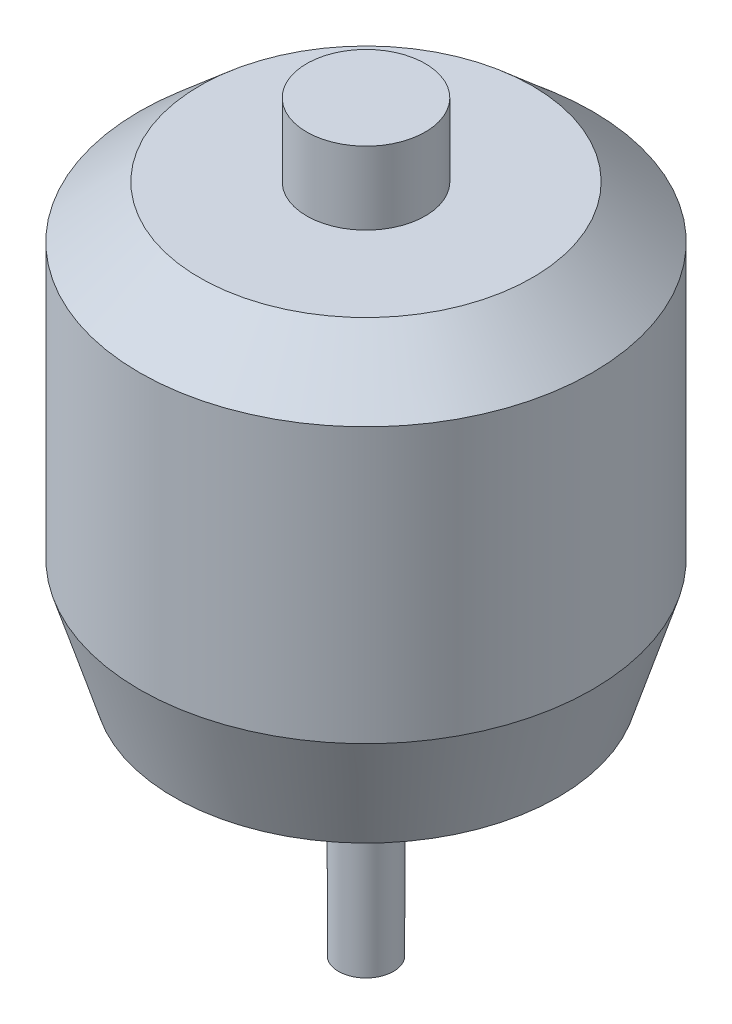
ISO-10303-21;
HEADER;
FILE_DESCRIPTION(('STEP AP214'),'2;1');
FILE_NAME('part.step','',(''),(''),'','','');
FILE_SCHEMA(('AUTOMOTIVE_DESIGN { 1 0 10303 214 1 1 1 1 }'));
ENDSEC;
DATA;
#1=APPLICATION_CONTEXT('core data for automotive mechanical design processes');
#2=APPLICATION_PROTOCOL_DEFINITION('international standard','automotive_design',2000,#1);
#3=PRODUCT_CONTEXT('',#1,'mechanical');
#4=PRODUCT('Part','Part','',(#3));
#5=PRODUCT_RELATED_PRODUCT_CATEGORY('part','',(#4));
#6=PRODUCT_DEFINITION_FORMATION('','',#4);
#7=PRODUCT_DEFINITION_CONTEXT('part definition',#1,'design');
#8=PRODUCT_DEFINITION('design','',#6,#7);
#9=PRODUCT_DEFINITION_SHAPE('','',#8);
#10=(LENGTH_UNIT() NAMED_UNIT(*) SI_UNIT(.MILLI.,.METRE.));
#11=(NAMED_UNIT(*) PLANE_ANGLE_UNIT() SI_UNIT($,.RADIAN.));
#12=(NAMED_UNIT(*) SI_UNIT($,.STERADIAN.) SOLID_ANGLE_UNIT());
#13=UNCERTAINTY_MEASURE_WITH_UNIT(LENGTH_MEASURE(1.E-05),#10,'distance_accuracy_value','');
#14=(GEOMETRIC_REPRESENTATION_CONTEXT(3) GLOBAL_UNCERTAINTY_ASSIGNED_CONTEXT((#13)) GLOBAL_UNIT_ASSIGNED_CONTEXT((#10,
#11,#12)) REPRESENTATION_CONTEXT('',''));
#15=CARTESIAN_POINT('',(0.,0.,0.));
#16=DIRECTION('',(0.,0.,1.));
#17=DIRECTION('',(1.,0.,0.));
#18=AXIS2_PLACEMENT_3D('',#15,#16,#17);
#19=CARTESIAN_POINT('',(0.,25.4,0.));
#20=DIRECTION('',(0.,-1.,0.));
#21=DIRECTION('',(0.,0.,-1.));
#22=AXIS2_PLACEMENT_3D('',#19,#20,#21);
#23=CYLINDRICAL_SURFACE('',#22,20.955);
#24=CARTESIAN_POINT('',(0.,25.4,0.));
#25=DIRECTION('',(0.,1.,0.));
#26=DIRECTION('',(0.,0.,1.));
#27=AXIS2_PLACEMENT_3D('',#24,#25,#26);
#28=CIRCLE('',#27,20.955);
#29=CARTESIAN_POINT('',(0.,25.4,20.955));
#30=VERTEX_POINT('',#29);
#31=EDGE_CURVE('E46',#30,#30,#28,.T.);
#32=ORIENTED_EDGE('',*,*,#31,.F.);
#33=EDGE_LOOP('',(#32));
#34=FACE_BOUND('',#33,.T.);
#35=CARTESIAN_POINT('',(0.,0.,0.));
#36=DIRECTION('',(0.,-1.,0.));
#37=DIRECTION('',(1.,0.,0.));
#38=AXIS2_PLACEMENT_3D('',#35,#36,#37);
#39=CIRCLE('',#38,20.955);
#40=CARTESIAN_POINT('',(20.955,0.,0.));
#41=VERTEX_POINT('',#40);
#42=EDGE_CURVE('E64',#41,#41,#39,.T.);
#43=ORIENTED_EDGE('',*,*,#42,.F.);
#44=EDGE_LOOP('',(#43));
#45=FACE_BOUND('',#44,.T.);
#46=ADVANCED_FACE('F36',(#34,#45),#23,.T.);
#47=CARTESIAN_POINT('',(0.,25.3999999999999,0.));
#48=DIRECTION('',(0.,-1.,0.));
#49=DIRECTION('',(0.,0.,-1.));
#50=AXIS2_PLACEMENT_3D('',#47,#48,#49);
#51=CONICAL_SURFACE('',#50,20.955,0.856184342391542);
#52=CARTESIAN_POINT('',(0.,30.226,0.));
#53=DIRECTION('',(0.,-1.,0.));
#54=DIRECTION('',(0.,0.,-1.));
#55=AXIS2_PLACEMENT_3D('',#52,#53,#54);
#56=CIRCLE('',#55,15.3924);
#57=CARTESIAN_POINT('',(0.,30.226,-15.3924));
#58=VERTEX_POINT('',#57);
#59=EDGE_CURVE('E51',#58,#58,#56,.T.);
#60=ORIENTED_EDGE('',*,*,#59,.T.);
#61=EDGE_LOOP('',(#60));
#62=FACE_BOUND('',#61,.T.);
#63=ORIENTED_EDGE('',*,*,#31,.T.);
#64=EDGE_LOOP('',(#63));
#65=FACE_BOUND('',#64,.T.);
#66=ADVANCED_FACE('F133',(#62,#65),#51,.T.);
#67=CARTESIAN_POINT('',(0.,30.226,-15.3924));
#68=DIRECTION('',(0.,1.,0.));
#69=DIRECTION('',(0.,0.,1.));
#70=AXIS2_PLACEMENT_3D('',#67,#68,#69);
#71=PLANE('',#70);
#72=CARTESIAN_POINT('',(0.,30.226,1.03682706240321E-13));
#73=DIRECTION('',(0.,1.,0.));
#74=DIRECTION('',(0.,0.,1.));
#75=AXIS2_PLACEMENT_3D('',#72,#73,#74);
#76=CIRCLE('',#75,5.4864);
#77=CARTESIAN_POINT('',(0.,30.226,5.4864000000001));
#78=VERTEX_POINT('',#77);
#79=EDGE_CURVE('E42',#78,#78,#76,.T.);
#80=ORIENTED_EDGE('',*,*,#79,.F.);
#81=EDGE_LOOP('',(#80));
#82=FACE_BOUND('',#81,.T.);
#83=ORIENTED_EDGE('',*,*,#59,.F.);
#84=EDGE_LOOP('',(#83));
#85=FACE_BOUND('',#84,.T.);
#86=ADVANCED_FACE('F138',(#82,#85),#71,.T.);
#87=CARTESIAN_POINT('',(0.,36.957,1.26771712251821E-13));
#88=DIRECTION('',(0.,-1.,0.));
#89=DIRECTION('',(0.,0.,-1.));
#90=AXIS2_PLACEMENT_3D('',#87,#88,#89);
#91=CYLINDRICAL_SURFACE('',#90,5.4864);
#92=CARTESIAN_POINT('',(0.,36.957,1.26771712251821E-13));
#93=DIRECTION('',(0.,1.,0.));
#94=DIRECTION('',(0.,0.,1.));
#95=AXIS2_PLACEMENT_3D('',#92,#93,#94);
#96=CIRCLE('',#95,5.4864);
#97=CARTESIAN_POINT('',(0.,36.957,5.48640000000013));
#98=VERTEX_POINT('',#97);
#99=EDGE_CURVE('E54',#98,#98,#96,.T.);
#100=ORIENTED_EDGE('',*,*,#99,.F.);
#101=EDGE_LOOP('',(#100));
#102=FACE_BOUND('',#101,.T.);
#103=ORIENTED_EDGE('',*,*,#79,.T.);
#104=EDGE_LOOP('',(#103));
#105=FACE_BOUND('',#104,.T.);
#106=ADVANCED_FACE('F155',(#102,#105),#91,.T.);
#107=CARTESIAN_POINT('',(0.,36.957,1.26771712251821E-13));
#108=DIRECTION('',(0.,1.,0.));
#109=DIRECTION('',(0.,0.,1.));
#110=AXIS2_PLACEMENT_3D('',#107,#108,#109);
#111=PLANE('',#110);
#112=ORIENTED_EDGE('',*,*,#99,.T.);
#113=EDGE_LOOP('',(#112));
#114=FACE_BOUND('',#113,.T.);
#115=ADVANCED_FACE('F111',(#114),#111,.T.);
#116=CARTESIAN_POINT('',(0.,-10.2108,0.));
#117=DIRECTION('',(0.,1.,0.));
#118=DIRECTION('',(-1.,0.,0.));
#119=AXIS2_PLACEMENT_3D('',#116,#117,#118);
#120=PLANE('',#119);
#121=CARTESIAN_POINT('',(-8.98025612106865,-10.2108,-8.98025612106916));
#122=DIRECTION('',(0.,-1.,0.));
#123=DIRECTION('',(1.,0.,0.));
#124=AXIS2_PLACEMENT_3D('',#121,#122,#123);
#125=CIRCLE('',#124,1.27000000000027);
#126=CARTESIAN_POINT('',(-7.71025612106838,-10.2108,-8.98025612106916));
#127=VERTEX_POINT('',#126);
#128=EDGE_CURVE('E80',#127,#127,#125,.T.);
#129=ORIENTED_EDGE('',*,*,#128,.F.);
#130=EDGE_LOOP('',(#129));
#131=FACE_BOUND('',#130,.T.);
#132=CARTESIAN_POINT('',(8.9802561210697,-10.2107999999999,-8.98025612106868));
#133=DIRECTION('',(0.,-1.,0.));
#134=DIRECTION('',(1.,0.,0.));
#135=AXIS2_PLACEMENT_3D('',#132,#133,#134);
#136=CIRCLE('',#135,1.27000000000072);
#137=CARTESIAN_POINT('',(10.2502561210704,-10.2107999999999,-8.98025612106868));
#138=VERTEX_POINT('',#137);
#139=EDGE_CURVE('E86',#138,#138,#136,.T.);
#140=ORIENTED_EDGE('',*,*,#139,.F.);
#141=EDGE_LOOP('',(#140));
#142=FACE_BOUND('',#141,.T.);
#143=CARTESIAN_POINT('',(8.98025612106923,-10.2107999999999,8.98025612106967));
#144=DIRECTION('',(0.,-1.,0.));
#145=DIRECTION('',(1.,0.,0.));
#146=AXIS2_PLACEMENT_3D('',#143,#144,#145);
#147=CIRCLE('',#146,1.27000000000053);
#148=CARTESIAN_POINT('',(10.2502561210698,-10.2107999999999,8.98025612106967));
#149=VERTEX_POINT('',#148);
#150=EDGE_CURVE('E92',#149,#149,#147,.T.);
#151=ORIENTED_EDGE('',*,*,#150,.F.);
#152=EDGE_LOOP('',(#151));
#153=FACE_BOUND('',#152,.T.);
#154=CARTESIAN_POINT('',(-8.98025612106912,-10.2108,8.98025612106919));
#155=DIRECTION('',(0.,-1.,0.));
#156=DIRECTION('',(1.,0.,0.));
#157=AXIS2_PLACEMENT_3D('',#154,#155,#156);
#158=CIRCLE('',#157,1.27);
#159=CARTESIAN_POINT('',(-7.71025612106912,-10.2108,8.98025612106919));
#160=VERTEX_POINT('',#159);
#161=EDGE_CURVE('E74',#160,#160,#158,.T.);
#162=ORIENTED_EDGE('',*,*,#161,.F.);
#163=EDGE_LOOP('',(#162));
#164=FACE_BOUND('',#163,.T.);
#165=CARTESIAN_POINT('',(0.,-10.2108,0.));
#166=DIRECTION('',(0.,1.,0.));
#167=DIRECTION('',(-1.,0.,0.));
#168=AXIS2_PLACEMENT_3D('',#165,#166,#167);
#169=CIRCLE('',#168,2.54);
#170=CARTESIAN_POINT('',(-2.53999999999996,-10.2108,0.));
#171=VERTEX_POINT('',#170);
#172=EDGE_CURVE('E10',#171,#171,#169,.F.);
#173=ORIENTED_EDGE('',*,*,#172,.F.);
#174=EDGE_LOOP('',(#173));
#175=FACE_BOUND('',#174,.T.);
#176=CARTESIAN_POINT('',(0.,-10.2107999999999,0.));
#177=DIRECTION('',(0.,-1.,0.));
#178=DIRECTION('',(1.,0.,0.));
#179=AXIS2_PLACEMENT_3D('',#176,#177,#178);
#180=CIRCLE('',#179,17.78);
#181=CARTESIAN_POINT('',(17.7800000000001,-10.2107999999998,0.));
#182=VERTEX_POINT('',#181);
#183=EDGE_CURVE('E60',#182,#182,#180,.T.);
#184=ORIENTED_EDGE('',*,*,#183,.T.);
#185=EDGE_LOOP('',(#184));
#186=FACE_BOUND('',#185,.T.);
#187=ADVANCED_FACE('F107',(#131,#142,#153,#164,#175,#186),#120,.F.);
#188=CARTESIAN_POINT('',(0.,0.,0.));
#189=DIRECTION('',(0.,1.,0.));
#190=DIRECTION('',(-1.,0.,0.));
#191=AXIS2_PLACEMENT_3D('',#188,#189,#190);
#192=CONICAL_SURFACE('',#191,20.955,0.301467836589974);
#193=ORIENTED_EDGE('',*,*,#183,.F.);
#194=EDGE_LOOP('',(#193));
#195=FACE_BOUND('',#194,.T.);
#196=ORIENTED_EDGE('',*,*,#42,.T.);
#197=EDGE_LOOP('',(#196));
#198=FACE_BOUND('',#197,.T.);
#199=ADVANCED_FACE('F110',(#195,#198),#192,.T.);
#200=CARTESIAN_POINT('',(1.09084662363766E-13,-31.8008,0.));
#201=DIRECTION('',(0.,1.,0.));
#202=DIRECTION('',(-1.,0.,0.));
#203=AXIS2_PLACEMENT_3D('',#200,#201,#202);
#204=CYLINDRICAL_SURFACE('',#203,2.54);
#205=CARTESIAN_POINT('',(1.09084662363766E-13,-31.8008,0.));
#206=DIRECTION('',(0.,-1.,0.));
#207=DIRECTION('',(1.,0.,0.));
#208=AXIS2_PLACEMENT_3D('',#205,#206,#207);
#209=CIRCLE('',#208,2.54);
#210=CARTESIAN_POINT('',(2.54000000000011,-31.8008,0.));
#211=VERTEX_POINT('',#210);
#212=EDGE_CURVE('E68',#211,#211,#209,.T.);
#213=ORIENTED_EDGE('',*,*,#212,.F.);
#214=EDGE_LOOP('',(#213));
#215=FACE_BOUND('',#214,.T.);
#216=ORIENTED_EDGE('',*,*,#172,.T.);
#217=EDGE_LOOP('',(#216));
#218=FACE_BOUND('',#217,.T.);
#219=ADVANCED_FACE('F128',(#215,#218),#204,.T.);
#220=CARTESIAN_POINT('',(1.09084662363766E-13,-31.8008,0.));
#221=DIRECTION('',(0.,-1.,0.));
#222=DIRECTION('',(1.,0.,0.));
#223=AXIS2_PLACEMENT_3D('',#220,#221,#222);
#224=PLANE('',#223);
#225=ORIENTED_EDGE('',*,*,#212,.T.);
#226=EDGE_LOOP('',(#225));
#227=FACE_BOUND('',#226,.T.);
#228=ADVANCED_FACE('F119',(#227),#224,.T.);
#229=CARTESIAN_POINT('',(-8.98025612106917,2.4892,8.98025612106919));
#230=DIRECTION('',(0.,-1.,0.));
#231=DIRECTION('',(1.,0.,0.));
#232=AXIS2_PLACEMENT_3D('',#229,#230,#231);
#233=CYLINDRICAL_SURFACE('',#232,1.27);
#234=CARTESIAN_POINT('',(-8.98025612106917,2.4892,8.98025612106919));
#235=DIRECTION('',(0.,-1.,0.));
#236=DIRECTION('',(1.,0.,0.));
#237=AXIS2_PLACEMENT_3D('',#234,#235,#236);
#238=CIRCLE('',#237,1.27);
#239=CARTESIAN_POINT('',(-7.71025612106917,2.4892,8.98025612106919));
#240=VERTEX_POINT('',#239);
#241=EDGE_CURVE('E73',#240,#240,#238,.T.);
#242=ORIENTED_EDGE('',*,*,#241,.F.);
#243=EDGE_LOOP('',(#242));
#244=FACE_BOUND('',#243,.T.);
#245=ORIENTED_EDGE('',*,*,#161,.T.);
#246=EDGE_LOOP('',(#245));
#247=FACE_BOUND('',#246,.T.);
#248=ADVANCED_FACE('F117',(#244,#247),#233,.F.);
#249=CARTESIAN_POINT('',(-8.98025612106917,2.4892,8.98025612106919));
#250=DIRECTION('',(0.,-1.,0.));
#251=DIRECTION('',(1.,0.,0.));
#252=AXIS2_PLACEMENT_3D('',#249,#250,#251);
#253=PLANE('',#252);
#254=ORIENTED_EDGE('',*,*,#241,.T.);
#255=EDGE_LOOP('',(#254));
#256=FACE_BOUND('',#255,.T.);
#257=ADVANCED_FACE('F103',(#256),#253,.T.);
#258=CARTESIAN_POINT('',(8.98025612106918,2.48920000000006,8.98025612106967));
#259=DIRECTION('',(0.,-1.,0.));
#260=DIRECTION('',(1.,0.,0.));
#261=AXIS2_PLACEMENT_3D('',#258,#259,#260);
#262=CYLINDRICAL_SURFACE('',#261,1.27000000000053);
#263=CARTESIAN_POINT('',(8.98025612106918,2.48920000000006,8.98025612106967));
#264=DIRECTION('',(0.,-1.,0.));
#265=DIRECTION('',(1.,0.,0.));
#266=AXIS2_PLACEMENT_3D('',#263,#264,#265);
#267=CIRCLE('',#266,1.27000000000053);
#268=CARTESIAN_POINT('',(10.2502561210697,2.48920000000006,8.98025612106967));
#269=VERTEX_POINT('',#268);
#270=EDGE_CURVE('E77',#269,#269,#267,.T.);
#271=ORIENTED_EDGE('',*,*,#270,.F.);
#272=EDGE_LOOP('',(#271));
#273=FACE_BOUND('',#272,.T.);
#274=ORIENTED_EDGE('',*,*,#150,.T.);
#275=EDGE_LOOP('',(#274));
#276=FACE_BOUND('',#275,.T.);
#277=ADVANCED_FACE('F100',(#273,#276),#262,.F.);
#278=CARTESIAN_POINT('',(8.98025612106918,2.48920000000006,8.98025612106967));
#279=DIRECTION('',(0.,-1.,0.));
#280=DIRECTION('',(1.,0.,0.));
#281=AXIS2_PLACEMENT_3D('',#278,#279,#280);
#282=PLANE('',#281);
#283=ORIENTED_EDGE('',*,*,#270,.T.);
#284=EDGE_LOOP('',(#283));
#285=FACE_BOUND('',#284,.T.);
#286=ADVANCED_FACE('F98',(#285),#282,.T.);
#287=CARTESIAN_POINT('',(8.98025612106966,2.48920000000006,-8.98025612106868));
#288=DIRECTION('',(0.,-1.,0.));
#289=DIRECTION('',(1.,0.,0.));
#290=AXIS2_PLACEMENT_3D('',#287,#288,#289);
#291=CYLINDRICAL_SURFACE('',#290,1.27000000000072);
#292=CARTESIAN_POINT('',(8.98025612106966,2.48920000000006,-8.98025612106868));
#293=DIRECTION('',(0.,-1.,0.));
#294=DIRECTION('',(1.,0.,0.));
#295=AXIS2_PLACEMENT_3D('',#292,#293,#294);
#296=CIRCLE('',#295,1.27000000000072);
#297=CARTESIAN_POINT('',(10.2502561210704,2.48920000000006,-8.98025612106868));
#298=VERTEX_POINT('',#297);
#299=EDGE_CURVE('E89',#298,#298,#296,.T.);
#300=ORIENTED_EDGE('',*,*,#299,.F.);
#301=EDGE_LOOP('',(#300));
#302=FACE_BOUND('',#301,.T.);
#303=ORIENTED_EDGE('',*,*,#139,.T.);
#304=EDGE_LOOP('',(#303));
#305=FACE_BOUND('',#304,.T.);
#306=ADVANCED_FACE('F207',(#302,#305),#291,.F.);
#307=CARTESIAN_POINT('',(8.98025612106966,2.48920000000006,-8.98025612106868));
#308=DIRECTION('',(0.,-1.,0.));
#309=DIRECTION('',(1.,0.,0.));
#310=AXIS2_PLACEMENT_3D('',#307,#308,#309);
#311=PLANE('',#310);
#312=ORIENTED_EDGE('',*,*,#299,.T.);
#313=EDGE_LOOP('',(#312));
#314=FACE_BOUND('',#313,.T.);
#315=ADVANCED_FACE('F216',(#314),#311,.T.);
#316=CARTESIAN_POINT('',(-8.98025612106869,2.4892,-8.98025612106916));
#317=DIRECTION('',(0.,-1.,0.));
#318=DIRECTION('',(1.,0.,0.));
#319=AXIS2_PLACEMENT_3D('',#316,#317,#318);
#320=CYLINDRICAL_SURFACE('',#319,1.27000000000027);
#321=CARTESIAN_POINT('',(-8.98025612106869,2.4892,-8.98025612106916));
#322=DIRECTION('',(0.,-1.,0.));
#323=DIRECTION('',(1.,0.,0.));
#324=AXIS2_PLACEMENT_3D('',#321,#322,#323);
#325=CIRCLE('',#324,1.27000000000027);
#326=CARTESIAN_POINT('',(-7.71025612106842,2.4892,-8.98025612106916));
#327=VERTEX_POINT('',#326);
#328=EDGE_CURVE('E83',#327,#327,#325,.T.);
#329=ORIENTED_EDGE('',*,*,#328,.F.);
#330=EDGE_LOOP('',(#329));
#331=FACE_BOUND('',#330,.T.);
#332=ORIENTED_EDGE('',*,*,#128,.T.);
#333=EDGE_LOOP('',(#332));
#334=FACE_BOUND('',#333,.T.);
#335=ADVANCED_FACE('F226',(#331,#334),#320,.F.);
#336=CARTESIAN_POINT('',(-8.98025612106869,2.4892,-8.98025612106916));
#337=DIRECTION('',(0.,-1.,0.));
#338=DIRECTION('',(1.,0.,0.));
#339=AXIS2_PLACEMENT_3D('',#336,#337,#338);
#340=PLANE('',#339);
#341=ORIENTED_EDGE('',*,*,#328,.T.);
#342=EDGE_LOOP('',(#341));
#343=FACE_BOUND('',#342,.T.);
#344=ADVANCED_FACE('F236',(#343),#340,.T.);
#345=CLOSED_SHELL('',(#46,#66,#86,#106,#115,#187,#199,#219,#228,#248,#257,#277,#286,#306,#315,
#335,#344));
#346=MANIFOLD_SOLID_BREP('B2',#345);
#347=ADVANCED_BREP_SHAPE_REPRESENTATION('',(#18,#346),#14);
#348=SHAPE_DEFINITION_REPRESENTATION(#9,#347);
ENDSEC;
END-ISO-10303-21;
